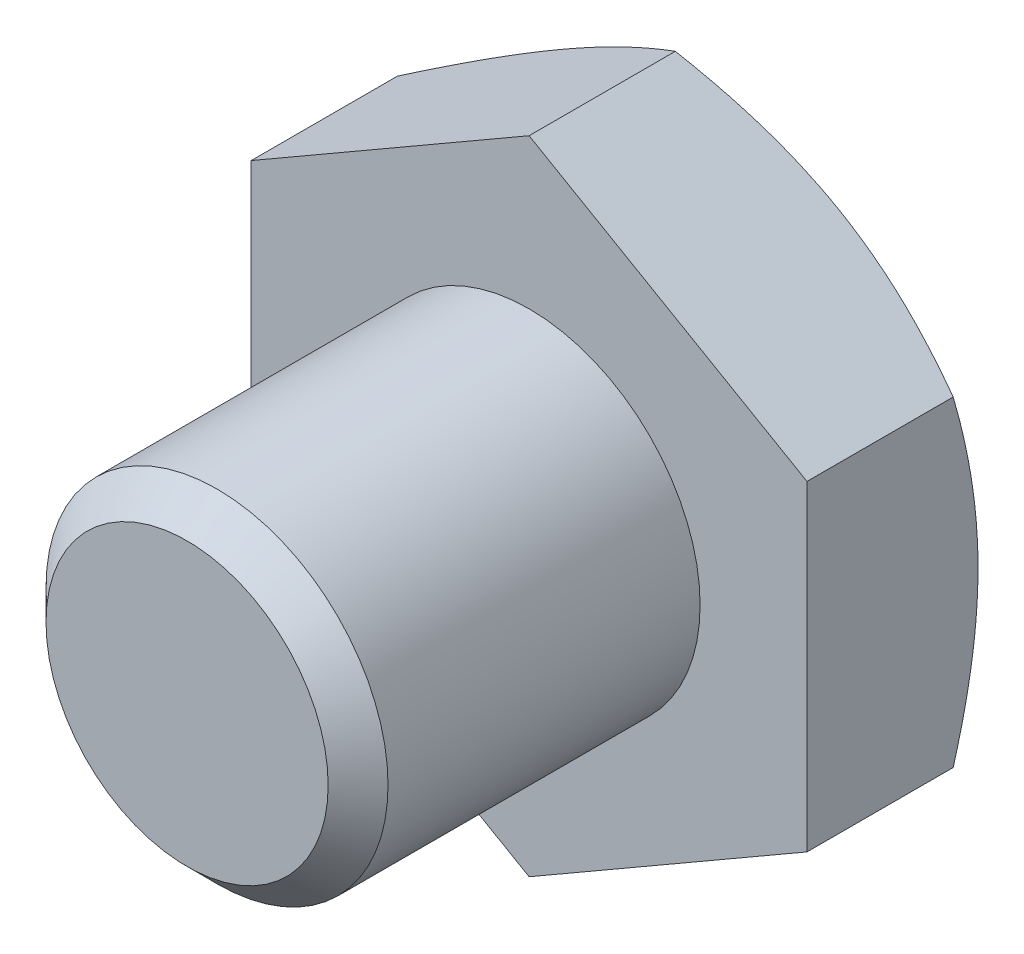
ISO-10303-21;
HEADER;
FILE_DESCRIPTION(('STEP AP214'),'2;1');
FILE_NAME('part.step','',(''),(''),'','','');
FILE_SCHEMA(('AUTOMOTIVE_DESIGN { 1 0 10303 214 1 1 1 1 }'));
ENDSEC;
DATA;
#1=APPLICATION_CONTEXT('core data for automotive mechanical design processes');
#2=APPLICATION_PROTOCOL_DEFINITION('international standard','automotive_design',2000,#1);
#3=PRODUCT_CONTEXT('',#1,'mechanical');
#4=PRODUCT('Part','Part','',(#3));
#5=PRODUCT_RELATED_PRODUCT_CATEGORY('part','',(#4));
#6=PRODUCT_DEFINITION_FORMATION('','',#4);
#7=PRODUCT_DEFINITION_CONTEXT('part definition',#1,'design');
#8=PRODUCT_DEFINITION('design','',#6,#7);
#9=PRODUCT_DEFINITION_SHAPE('','',#8);
#10=(LENGTH_UNIT() NAMED_UNIT(*) SI_UNIT(.MILLI.,.METRE.));
#11=(NAMED_UNIT(*) PLANE_ANGLE_UNIT() SI_UNIT($,.RADIAN.));
#12=(NAMED_UNIT(*) SI_UNIT($,.STERADIAN.) SOLID_ANGLE_UNIT());
#13=UNCERTAINTY_MEASURE_WITH_UNIT(LENGTH_MEASURE(1.E-05),#10,'distance_accuracy_value','');
#14=(GEOMETRIC_REPRESENTATION_CONTEXT(3) GLOBAL_UNCERTAINTY_ASSIGNED_CONTEXT((#13)) GLOBAL_UNIT_ASSIGNED_CONTEXT((#10,
#11,#12)) REPRESENTATION_CONTEXT('',''));
#15=CARTESIAN_POINT('',(0.,0.,0.));
#16=DIRECTION('',(0.,0.,1.));
#17=DIRECTION('',(1.,0.,0.));
#18=AXIS2_PLACEMENT_3D('',#15,#16,#17);
#19=CARTESIAN_POINT('',(0.,0.,8.));
#20=DIRECTION('',(0.,0.,1.));
#21=DIRECTION('',(1.,0.,0.));
#22=AXIS2_PLACEMENT_3D('',#19,#20,#21);
#23=PLANE('',#22);
#24=CARTESIAN_POINT('',(0.,0.,8.));
#25=DIRECTION('',(0.,0.,1.));
#26=DIRECTION('',(1.,0.,0.));
#27=AXIS2_PLACEMENT_3D('',#24,#25,#26);
#28=CIRCLE('',#27,3.3);
#29=CARTESIAN_POINT('',(3.3,0.,8.));
#30=VERTEX_POINT('',#29);
#31=EDGE_CURVE('E203',#30,#30,#28,.T.);
#32=ORIENTED_EDGE('',*,*,#31,.T.);
#33=EDGE_LOOP('',(#32));
#34=FACE_BOUND('',#33,.T.);
#35=ADVANCED_FACE('F29',(#34),#23,.T.);
#36=CARTESIAN_POINT('',(0.,0.,0.));
#37=DIRECTION('',(0.,0.,1.));
#38=DIRECTION('',(1.,0.,0.));
#39=AXIS2_PLACEMENT_3D('',#36,#37,#38);
#40=CYLINDRICAL_SURFACE('',#39,4.);
#41=CARTESIAN_POINT('',(0.,0.,7.29999999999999));
#42=DIRECTION('',(0.,0.,1.));
#43=DIRECTION('',(1.,0.,0.));
#44=AXIS2_PLACEMENT_3D('',#41,#42,#43);
#45=CIRCLE('',#44,4.);
#46=CARTESIAN_POINT('',(4.,0.,7.29999999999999));
#47=VERTEX_POINT('',#46);
#48=EDGE_CURVE('E205',#47,#47,#45,.F.);
#49=ORIENTED_EDGE('',*,*,#48,.T.);
#50=EDGE_LOOP('',(#49));
#51=FACE_BOUND('',#50,.T.);
#52=CARTESIAN_POINT('',(0.,0.,0.));
#53=DIRECTION('',(0.,0.,1.));
#54=DIRECTION('',(1.,0.,0.));
#55=AXIS2_PLACEMENT_3D('',#52,#53,#54);
#56=CIRCLE('',#55,4.);
#57=CARTESIAN_POINT('',(4.,0.,0.));
#58=VERTEX_POINT('',#57);
#59=EDGE_CURVE('E206',#58,#58,#56,.F.);
#60=ORIENTED_EDGE('',*,*,#59,.F.);
#61=EDGE_LOOP('',(#60));
#62=FACE_BOUND('',#61,.T.);
#63=ADVANCED_FACE('F194',(#51,#62),#40,.T.);
#64=CARTESIAN_POINT('',(0.,0.,8.));
#65=DIRECTION('',(0.,0.,-1.));
#66=DIRECTION('',(-1.,0.,0.));
#67=AXIS2_PLACEMENT_3D('',#64,#65,#66);
#68=CONICAL_SURFACE('',#67,3.3,0.785398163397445);
#69=ORIENTED_EDGE('',*,*,#48,.F.);
#70=EDGE_LOOP('',(#69));
#71=FACE_BOUND('',#70,.T.);
#72=ORIENTED_EDGE('',*,*,#31,.F.);
#73=EDGE_LOOP('',(#72));
#74=FACE_BOUND('',#73,.T.);
#75=ADVANCED_FACE('F199',(#71,#74),#68,.T.);
#76=CARTESIAN_POINT('',(0.,7.50555349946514,-4.));
#77=DIRECTION('',(0.499999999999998,0.86602540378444,0.));
#78=DIRECTION('',(-0.86602540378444,0.499999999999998,0.));
#79=AXIS2_PLACEMENT_3D('',#76,#77,#78);
#80=PLANE('',#79);
#81=CARTESIAN_POINT('',(-0.000200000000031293,7.50566896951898,-3.41937674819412));
#82=CARTESIAN_POINT('',(0.14267745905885,7.42317863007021,-3.46699557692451));
#83=CARTESIAN_POINT('',(0.286087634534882,7.34038072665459,-3.51245329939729));
#84=CARTESIAN_POINT('',(0.574072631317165,7.17411251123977,-3.59845131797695));
#85=CARTESIAN_POINT('',(0.718647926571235,7.09064192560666,-3.63898949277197));
#86=CARTESIAN_POINT('',(1.15468865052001,6.8388936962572,-3.75242899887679));
#87=CARTESIAN_POINT('',(1.44787528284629,6.66962231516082,-3.81695219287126));
#88=CARTESIAN_POINT('',(1.88662374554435,6.41631077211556,-3.89261341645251));
#89=CARTESIAN_POINT('',(2.03087463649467,6.33302748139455,-3.91416714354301));
#90=CARTESIAN_POINT('',(2.32002821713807,6.16608458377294,-3.95030968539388));
#91=CARTESIAN_POINT('',(2.46493084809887,6.08242501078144,-3.96489911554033));
#92=CARTESIAN_POINT('',(2.7549877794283,5.91496056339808,-3.98674124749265));
#93=CARTESIAN_POINT('',(2.90014160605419,5.83115596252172,-3.99400227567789));
#94=CARTESIAN_POINT('',(3.19057533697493,5.66347396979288,-4.00103969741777));
#95=CARTESIAN_POINT('',(3.33585523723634,5.57959658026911,-4.0008163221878));
#96=CARTESIAN_POINT('',(3.73387594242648,5.34979921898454,-3.98991654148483));
#97=CARTESIAN_POINT('',(3.98648646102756,5.20395446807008,-3.97161818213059));
#98=CARTESIAN_POINT('',(4.49002967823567,4.91323365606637,-3.91359365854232));
#99=CARTESIAN_POINT('',(4.74096060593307,4.76835861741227,-3.87384766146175));
#100=CARTESIAN_POINT('',(5.24551722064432,4.47705272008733,-3.77449409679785));
#101=CARTESIAN_POINT('',(5.49907924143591,4.33065861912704,-3.71446557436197));
#102=CARTESIAN_POINT('',(6.00242193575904,4.04005357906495,-3.57822500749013));
#103=CARTESIAN_POINT('',(6.25220905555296,3.89583891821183,-3.5020449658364));
#104=CARTESIAN_POINT('',(6.5002,3.75266127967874,-3.41937674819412));
#105=B_SPLINE_CURVE_WITH_KNOTS('',3,(#81,#82,#83,#84,#85,#86,#87,#88,#89,#90,#91,#92,#93,#94,
#95,#96,#97,#98,#99,#100,#101,#102,#103,#104),.UNSPECIFIED.,.F.,.F.,(4,2,2,2,2,2,2,2,2,2,2,4),
(0.,0.515105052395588,1.03043143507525,2.06322554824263,2.56697389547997,3.07067772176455,
3.57380860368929,4.07692394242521,4.95279354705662,5.82947446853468,6.72559912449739,
7.61996451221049),.UNSPECIFIED.);
#106=CARTESIAN_POINT('',(0.,7.50555349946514,-3.41944341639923));
#107=VERTEX_POINT('',#106);
#108=CARTESIAN_POINT('',(3.24999999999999,5.62916512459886,-4.));
#109=VERTEX_POINT('',#108);
#110=EDGE_CURVE('E239',#107,#109,#105,.T.);
#111=ORIENTED_EDGE('',*,*,#110,.F.);
#112=DIRECTION('',(0.,0.,1.));
#113=VECTOR('',#112,1.);
#114=CARTESIAN_POINT('',(0.,7.50555349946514,-4.));
#115=LINE('',#114,#113);
#116=CARTESIAN_POINT('',(0.,7.50555349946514,0.));
#117=VERTEX_POINT('',#116);
#118=EDGE_CURVE('E213',#107,#117,#115,.T.);
#119=ORIENTED_EDGE('',*,*,#118,.T.);
#120=DIRECTION('',(-0.86602540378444,0.499999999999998,0.));
#121=VECTOR('',#120,1.);
#122=CARTESIAN_POINT('',(0.,7.50555349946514,0.));
#123=LINE('',#122,#121);
#124=CARTESIAN_POINT('',(6.5,3.75277674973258,0.));
#125=VERTEX_POINT('',#124);
#126=EDGE_CURVE('E237',#125,#117,#123,.T.);
#127=ORIENTED_EDGE('',*,*,#126,.F.);
#128=DIRECTION('',(0.,0.,1.));
#129=VECTOR('',#128,1.);
#130=CARTESIAN_POINT('',(6.5,3.75277674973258,-4.));
#131=LINE('',#130,#129);
#132=CARTESIAN_POINT('',(6.5,3.75277674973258,-3.41944341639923));
#133=VERTEX_POINT('',#132);
#134=EDGE_CURVE('E210',#133,#125,#131,.T.);
#135=ORIENTED_EDGE('',*,*,#134,.F.);
#136=EDGE_CURVE('E169',#109,#133,#105,.T.);
#137=ORIENTED_EDGE('',*,*,#136,.F.);
#138=EDGE_LOOP('',(#111,#119,#127,#135,#137));
#139=FACE_BOUND('',#138,.T.);
#140=ADVANCED_FACE('F179',(#139),#80,.T.);
#141=CARTESIAN_POINT('',(6.5,-3.75277674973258,-4.));
#142=DIRECTION('',(1.,0.,0.));
#143=DIRECTION('',(0.,1.,0.));
#144=AXIS2_PLACEMENT_3D('',#141,#142,#143);
#145=PLANE('',#144);
#146=CARTESIAN_POINT('',(6.5,-10.1511481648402,-0.793471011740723));
#147=CARTESIAN_POINT('',(6.5,-9.86661061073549,-0.931780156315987));
#148=CARTESIAN_POINT('',(6.5,-9.5814273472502,-1.06878329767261));
#149=CARTESIAN_POINT('',(6.5,-9.00942621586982,-1.33944431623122));
#150=CARTESIAN_POINT('',(6.5,-8.72260810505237,-1.47310167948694));
#151=CARTESIAN_POINT('',(6.5,-8.14555045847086,-1.73699502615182));
#152=CARTESIAN_POINT('',(6.5,-7.85530083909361,-1.86720903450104));
#153=CARTESIAN_POINT('',(6.5,-7.27251720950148,-2.12240075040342));
#154=CARTESIAN_POINT('',(6.5,-6.97998330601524,-2.24737870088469));
#155=CARTESIAN_POINT('',(6.5,-6.38253578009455,-2.49470464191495));
#156=CARTESIAN_POINT('',(6.5,-6.07753050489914,-2.61683241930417));
#157=CARTESIAN_POINT('',(6.5,-5.4639777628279,-2.85201489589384));
#158=CARTESIAN_POINT('',(6.5,-5.15542990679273,-2.96506858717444));
#159=CARTESIAN_POINT('',(6.5,-4.53485688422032,-3.17918767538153));
#160=CARTESIAN_POINT('',(6.5,-4.22283995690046,-3.28027671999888));
#161=CARTESIAN_POINT('',(6.5,-3.59432776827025,-3.467268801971));
#162=CARTESIAN_POINT('',(6.5,-3.27783392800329,-3.55317654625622));
#163=CARTESIAN_POINT('',(6.5,-2.64193299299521,-3.70528378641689));
#164=CARTESIAN_POINT('',(6.5,-2.32255189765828,-3.7715902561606));
#165=CARTESIAN_POINT('',(6.5,-1.67970017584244,-3.88076810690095));
#166=CARTESIAN_POINT('',(6.5,-1.35622997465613,-3.92364190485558));
#167=CARTESIAN_POINT('',(6.5,-0.871400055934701,-3.96753437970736));
#168=CARTESIAN_POINT('',(6.5,-0.710924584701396,-3.97875364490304));
#169=CARTESIAN_POINT('',(6.5,-0.389635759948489,-3.99439800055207));
#170=CARTESIAN_POINT('',(6.5,-0.228822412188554,-3.99882320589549));
#171=CARTESIAN_POINT('',(6.5,0.0928467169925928,-4.00076623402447));
#172=CARTESIAN_POINT('',(6.5,0.253702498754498,-3.9982839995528));
#173=CARTESIAN_POINT('',(6.5,0.575165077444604,-3.98647562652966));
#174=CARTESIAN_POINT('',(6.5,0.735771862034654,-3.97714915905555));
#175=CARTESIAN_POINT('',(6.5,1.1195616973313,-3.94688326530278));
#176=CARTESIAN_POINT('',(6.5,1.34250362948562,-3.92281852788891));
#177=CARTESIAN_POINT('',(6.5,1.7867691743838,-3.86279653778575));
#178=CARTESIAN_POINT('',(6.5,2.00809257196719,-3.82683773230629));
#179=CARTESIAN_POINT('',(6.5,2.6693552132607,-3.70302394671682));
#180=CARTESIAN_POINT('',(6.5,3.10635568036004,-3.59925227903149));
#181=CARTESIAN_POINT('',(6.5,3.76002718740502,-3.41880250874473));
#182=CARTESIAN_POINT('',(6.5,3.98007311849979,-3.35364298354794));
#183=CARTESIAN_POINT('',(6.5,4.41802816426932,-3.21643617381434));
#184=CARTESIAN_POINT('',(6.5,4.63593726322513,-3.14438883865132));
#185=CARTESIAN_POINT('',(6.5,5.06968702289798,-2.99457255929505));
#186=CARTESIAN_POINT('',(6.5,5.28552829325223,-2.916805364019));
#187=CARTESIAN_POINT('',(6.5,5.71541228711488,-2.75647654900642));
#188=CARTESIAN_POINT('',(6.5,5.9294550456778,-2.67391502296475));
#189=CARTESIAN_POINT('',(6.5,6.48683269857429,-2.45289360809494));
#190=CARTESIAN_POINT('',(6.5,6.82889406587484,-2.31122578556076));
#191=CARTESIAN_POINT('',(6.5,7.50966899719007,-2.0200359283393));
#192=CARTESIAN_POINT('',(6.5,7.84838223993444,-1.87051314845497));
#193=CARTESIAN_POINT('',(6.5,8.5231934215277,-1.5654022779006));
#194=CARTESIAN_POINT('',(6.5,8.85929044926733,-1.40981217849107));
#195=CARTESIAN_POINT('',(6.5,9.5292616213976,-1.09396134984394));
#196=CARTESIAN_POINT('',(6.5,9.86313584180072,-0.933700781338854));
#197=CARTESIAN_POINT('',(6.5,10.5295677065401,-0.60925556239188));
#198=CARTESIAN_POINT('',(6.5,10.8621227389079,-0.445065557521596));
#199=CARTESIAN_POINT('',(6.5,11.5257555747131,-0.113725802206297));
#200=CARTESIAN_POINT('',(6.5,11.8568333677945,0.0534239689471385));
#201=CARTESIAN_POINT('',(6.5,12.5177031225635,0.390087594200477));
#202=CARTESIAN_POINT('',(6.5,12.8474953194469,0.559600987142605));
#203=CARTESIAN_POINT('',(6.5,13.5060616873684,0.900594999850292));
#204=CARTESIAN_POINT('',(6.5,13.8348358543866,1.07207562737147));
#205=CARTESIAN_POINT('',(6.5,14.7542734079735,1.55452408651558));
#206=CARTESIAN_POINT('',(6.50000000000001,15.3439832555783,1.86730883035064));
#207=CARTESIAN_POINT('',(6.50000000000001,16.5213822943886,2.49672516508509));
#208=CARTESIAN_POINT('',(6.50000000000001,17.1090713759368,2.81335696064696));
#209=CARTESIAN_POINT('',(6.50000000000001,18.2810762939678,3.44851591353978));
#210=CARTESIAN_POINT('',(6.50000000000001,18.8653969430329,3.76703419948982));
#211=CARTESIAN_POINT('',(6.50000000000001,20.0327707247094,4.40628789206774));
#212=CARTESIAN_POINT('',(6.50000000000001,20.6158239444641,4.72702313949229));
#213=CARTESIAN_POINT('',(6.50000000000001,21.1984268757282,5.0485682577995));
#214=B_SPLINE_CURVE_WITH_KNOTS('',3,(#146,#147,#148,#149,#150,#151,#152,#153,#154,#155,#156,
#157,#158,#159,#160,#161,#162,#163,#164,#165,#166,#167,#168,#169,#170,#171,#172,#173,#174,#175,
#176,#177,#178,#179,#180,#181,#182,#183,#184,#185,#186,#187,#188,#189,#190,#191,#192,#193,#194,
#195,#196,#197,#198,#199,#200,#201,#202,#203,#204,#205,#206,#207,#208,#209,#210,#211,#212,#213),
.UNSPECIFIED.,.F.,.F.,(4,2,2,2,2,2,2,2,2,2,2,2,2,2,2,2,2,2,2,2,2,2,2,2,2,2,2,2,2,2,2,2,2,4),(0.,
0.949126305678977,1.89839752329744,2.85271700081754,3.80699215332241,4.79252293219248,
5.77816302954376,6.76182130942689,7.7451740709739,8.72305667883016,9.70083840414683,
10.1833179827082,10.6657894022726,11.1482648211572,11.63076342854,12.3030962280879,
12.9755168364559,14.321051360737,15.0094640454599,15.6978817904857,16.3860899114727,
17.0742845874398,18.1848536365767,19.295528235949,20.4065737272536,21.5175810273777,
22.6301997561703,23.7428262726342,24.8552386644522,25.9676554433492,27.9702138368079,
29.9728792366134,31.9693608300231,33.9657005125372),.UNSPECIFIED.);
#215=CARTESIAN_POINT('',(6.5,0.,-4.));
#216=VERTEX_POINT('',#215);
#217=EDGE_CURVE('E167',#133,#216,#214,.F.);
#218=ORIENTED_EDGE('',*,*,#217,.F.);
#219=ORIENTED_EDGE('',*,*,#134,.T.);
#220=DIRECTION('',(0.,1.,0.));
#221=VECTOR('',#220,1.);
#222=CARTESIAN_POINT('',(6.5,-3.75277674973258,0.));
#223=LINE('',#222,#221);
#224=CARTESIAN_POINT('',(6.5,-3.75277674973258,0.));
#225=VERTEX_POINT('',#224);
#226=EDGE_CURVE('E215',#225,#125,#223,.T.);
#227=ORIENTED_EDGE('',*,*,#226,.F.);
#228=DIRECTION('',(0.,0.,1.));
#229=VECTOR('',#228,1.);
#230=CARTESIAN_POINT('',(6.5,-3.75277674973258,-4.));
#231=LINE('',#230,#229);
#232=CARTESIAN_POINT('',(6.5,-3.75277674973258,-3.41944341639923));
#233=VERTEX_POINT('',#232);
#234=EDGE_CURVE('E221',#233,#225,#231,.T.);
#235=ORIENTED_EDGE('',*,*,#234,.F.);
#236=EDGE_CURVE('E162',#216,#233,#214,.F.);
#237=ORIENTED_EDGE('',*,*,#236,.F.);
#238=EDGE_LOOP('',(#218,#219,#227,#235,#237));
#239=FACE_BOUND('',#238,.T.);
#240=ADVANCED_FACE('F175',(#239),#145,.T.);
#241=CARTESIAN_POINT('',(0.,-7.50555349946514,-4.));
#242=DIRECTION('',(0.499999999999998,-0.86602540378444,0.));
#243=DIRECTION('',(0.86602540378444,0.499999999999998,0.));
#244=AXIS2_PLACEMENT_3D('',#241,#242,#243);
#245=PLANE('',#244);
#246=CARTESIAN_POINT('',(6.5002,-3.75266127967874,-3.41937674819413));
#247=CARTESIAN_POINT('',(6.35732254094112,-3.83515161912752,-3.46699557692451));
#248=CARTESIAN_POINT('',(6.21391236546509,-3.91794952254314,-3.51245329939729));
#249=CARTESIAN_POINT('',(5.9259273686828,-4.08421773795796,-3.59845131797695));
#250=CARTESIAN_POINT('',(5.78135207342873,-4.16768832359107,-3.63898949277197));
#251=CARTESIAN_POINT('',(5.34531134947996,-4.41943655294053,-3.75242899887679));
#252=CARTESIAN_POINT('',(5.05212471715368,-4.58870793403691,-3.81695219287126));
#253=CARTESIAN_POINT('',(4.61337625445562,-4.84201947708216,-3.89261341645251));
#254=CARTESIAN_POINT('',(4.4691253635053,-4.92530276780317,-3.91416714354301));
#255=CARTESIAN_POINT('',(4.17997178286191,-5.09224566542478,-3.95030968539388));
#256=CARTESIAN_POINT('',(4.0350691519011,-5.17590523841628,-3.96489911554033));
#257=CARTESIAN_POINT('',(3.74501222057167,-5.34336968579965,-3.98674124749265));
#258=CARTESIAN_POINT('',(3.59985839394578,-5.42717428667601,-3.99400227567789));
#259=CARTESIAN_POINT('',(3.30942466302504,-5.59485627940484,-4.00103969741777));
#260=CARTESIAN_POINT('',(3.16414476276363,-5.67873366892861,-4.0008163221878));
#261=CARTESIAN_POINT('',(2.76612405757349,-5.90853103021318,-3.98991654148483));
#262=CARTESIAN_POINT('',(2.51351353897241,-6.05437578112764,-3.97161818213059));
#263=CARTESIAN_POINT('',(2.0099703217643,-6.34509659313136,-3.91359365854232));
#264=CARTESIAN_POINT('',(1.7590393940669,-6.48997163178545,-3.87384766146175));
#265=CARTESIAN_POINT('',(1.25448277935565,-6.78127752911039,-3.77449409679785));
#266=CARTESIAN_POINT('',(1.00092075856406,-6.92767163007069,-3.71446557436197));
#267=CARTESIAN_POINT('',(0.497578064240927,-7.21827667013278,-3.57822500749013));
#268=CARTESIAN_POINT('',(0.247790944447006,-7.3624913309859,-3.5020449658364));
#269=CARTESIAN_POINT('',(-0.00020000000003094,-7.50566896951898,-3.41937674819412));
#270=B_SPLINE_CURVE_WITH_KNOTS('',3,(#246,#247,#248,#249,#250,#251,#252,#253,#254,#255,#256,
#257,#258,#259,#260,#261,#262,#263,#264,#265,#266,#267,#268,#269),.UNSPECIFIED.,.F.,.F.,(4,2,2,
2,2,2,2,2,2,2,2,4),(0.,0.515105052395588,1.03043143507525,2.06322554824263,2.56697389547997,
3.07067772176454,3.57380860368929,4.07692394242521,4.95279354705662,5.82947446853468,
6.72559912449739,7.61996451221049),.UNSPECIFIED.);
#271=CARTESIAN_POINT('',(3.24999999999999,-5.62916512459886,-4.));
#272=VERTEX_POINT('',#271);
#273=EDGE_CURVE('E168',#233,#272,#270,.T.);
#274=ORIENTED_EDGE('',*,*,#273,.F.);
#275=ORIENTED_EDGE('',*,*,#234,.T.);
#276=DIRECTION('',(0.86602540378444,0.499999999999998,0.));
#277=VECTOR('',#276,1.);
#278=CARTESIAN_POINT('',(0.,-7.50555349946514,0.));
#279=LINE('',#278,#277);
#280=CARTESIAN_POINT('',(0.,-7.50555349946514,0.));
#281=VERTEX_POINT('',#280);
#282=EDGE_CURVE('E226',#281,#225,#279,.T.);
#283=ORIENTED_EDGE('',*,*,#282,.F.);
#284=DIRECTION('',(0.,0.,1.));
#285=VECTOR('',#284,1.);
#286=CARTESIAN_POINT('',(0.,-7.50555349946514,-4.));
#287=LINE('',#286,#285);
#288=CARTESIAN_POINT('',(0.,-7.50555349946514,-3.41944341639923));
#289=VERTEX_POINT('',#288);
#290=EDGE_CURVE('E219',#289,#281,#287,.T.);
#291=ORIENTED_EDGE('',*,*,#290,.F.);
#292=EDGE_CURVE('E156',#272,#289,#270,.T.);
#293=ORIENTED_EDGE('',*,*,#292,.F.);
#294=EDGE_LOOP('',(#274,#275,#283,#291,#293));
#295=FACE_BOUND('',#294,.T.);
#296=ADVANCED_FACE('F178',(#295),#245,.T.);
#297=CARTESIAN_POINT('',(0.,-7.50555349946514,-4.));
#298=DIRECTION('',(-0.500000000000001,-0.866025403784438,0.));
#299=DIRECTION('',(0.866025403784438,-0.500000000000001,0.));
#300=AXIS2_PLACEMENT_3D('',#297,#298,#299);
#301=PLANE('',#300);
#302=CARTESIAN_POINT('',(0.000199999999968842,-7.50566896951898,-3.41937674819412));
#303=CARTESIAN_POINT('',(-0.142677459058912,-7.42317863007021,-3.46699557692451));
#304=CARTESIAN_POINT('',(-0.286087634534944,-7.34038072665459,-3.51245329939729));
#305=CARTESIAN_POINT('',(-0.574072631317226,-7.17411251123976,-3.59845131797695));
#306=CARTESIAN_POINT('',(-0.718647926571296,-7.09064192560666,-3.63898949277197));
#307=CARTESIAN_POINT('',(-1.15468865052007,-6.83889369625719,-3.75242899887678));
#308=CARTESIAN_POINT('',(-1.44787528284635,-6.66962231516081,-3.81695219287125));
#309=CARTESIAN_POINT('',(-1.88662374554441,-6.41631077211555,-3.8926134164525));
#310=CARTESIAN_POINT('',(-2.03087463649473,-6.33302748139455,-3.91416714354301));
#311=CARTESIAN_POINT('',(-2.32002821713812,-6.16608458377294,-3.95030968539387));
#312=CARTESIAN_POINT('',(-2.46493084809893,-6.08242501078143,-3.96489911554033));
#313=CARTESIAN_POINT('',(-2.75498777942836,-5.91496056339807,-3.98674124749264));
#314=CARTESIAN_POINT('',(-2.90014160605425,-5.8311559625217,-3.99400227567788));
#315=CARTESIAN_POINT('',(-3.19057533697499,-5.66347396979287,-4.00103969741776));
#316=CARTESIAN_POINT('',(-3.3358552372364,-5.5795965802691,-4.00081632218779));
#317=CARTESIAN_POINT('',(-3.73387594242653,-5.34979921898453,-3.98991654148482));
#318=CARTESIAN_POINT('',(-3.9864864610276,-5.20395446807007,-3.97161818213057));
#319=CARTESIAN_POINT('',(-4.4900296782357,-4.91323365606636,-3.91359365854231));
#320=CARTESIAN_POINT('',(-4.74096060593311,-4.76835861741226,-3.87384766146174));
#321=CARTESIAN_POINT('',(-5.24551722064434,-4.47705272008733,-3.77449409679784));
#322=CARTESIAN_POINT('',(-5.49907924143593,-4.33065861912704,-3.71446557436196));
#323=CARTESIAN_POINT('',(-6.00242193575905,-4.04005357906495,-3.57822500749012));
#324=CARTESIAN_POINT('',(-6.25220905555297,-3.89583891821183,-3.5020449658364));
#325=CARTESIAN_POINT('',(-6.5002,-3.75266127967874,-3.41937674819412));
#326=B_SPLINE_CURVE_WITH_KNOTS('',3,(#302,#303,#304,#305,#306,#307,#308,#309,#310,#311,#312,
#313,#314,#315,#316,#317,#318,#319,#320,#321,#322,#323,#324,#325),.UNSPECIFIED.,.F.,.F.,(4,2,2,
2,2,2,2,2,2,2,2,4),(0.,0.515105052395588,1.03043143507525,2.06322554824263,2.56697389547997,
3.07067772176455,3.57380860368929,4.07692394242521,4.9527935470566,5.82947446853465,
6.72559912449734,7.61996451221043),.UNSPECIFIED.);
#327=CARTESIAN_POINT('',(-3.25000000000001,-5.62916512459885,-4.));
#328=VERTEX_POINT('',#327);
#329=EDGE_CURVE('E258',#289,#328,#326,.T.);
#330=ORIENTED_EDGE('',*,*,#329,.F.);
#331=ORIENTED_EDGE('',*,*,#290,.T.);
#332=DIRECTION('',(0.866025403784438,-0.500000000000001,0.));
#333=VECTOR('',#332,1.);
#334=CARTESIAN_POINT('',(0.,-7.50555349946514,0.));
#335=LINE('',#334,#333);
#336=CARTESIAN_POINT('',(-6.5,-3.75277674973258,0.));
#337=VERTEX_POINT('',#336);
#338=EDGE_CURVE('E229',#337,#281,#335,.T.);
#339=ORIENTED_EDGE('',*,*,#338,.F.);
#340=DIRECTION('',(0.,0.,1.));
#341=VECTOR('',#340,1.);
#342=CARTESIAN_POINT('',(-6.5,-3.75277674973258,-4.));
#343=LINE('',#342,#341);
#344=CARTESIAN_POINT('',(-6.5,-3.75277674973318,-3.41944341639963));
#345=VERTEX_POINT('',#344);
#346=EDGE_CURVE('E217',#345,#337,#343,.T.);
#347=ORIENTED_EDGE('',*,*,#346,.F.);
#348=EDGE_CURVE('E105',#328,#345,#326,.T.);
#349=ORIENTED_EDGE('',*,*,#348,.F.);
#350=EDGE_LOOP('',(#330,#331,#339,#347,#349));
#351=FACE_BOUND('',#350,.T.);
#352=ADVANCED_FACE('F183',(#351),#301,.T.);
#353=CARTESIAN_POINT('',(-6.5,-3.75277674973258,-4.));
#354=DIRECTION('',(-1.,0.,0.));
#355=DIRECTION('',(0.,0.,1.));
#356=AXIS2_PLACEMENT_3D('',#353,#354,#355);
#357=PLANE('',#356);
#358=CARTESIAN_POINT('',(-6.5,-10.1511481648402,-0.793471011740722));
#359=CARTESIAN_POINT('',(-6.5,-9.86661061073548,-0.931780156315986));
#360=CARTESIAN_POINT('',(-6.5,-9.58142734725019,-1.06878329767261));
#361=CARTESIAN_POINT('',(-6.5,-9.00942621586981,-1.33944431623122));
#362=CARTESIAN_POINT('',(-6.5,-8.72260810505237,-1.47310167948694));
#363=CARTESIAN_POINT('',(-6.5,-8.14555045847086,-1.73699502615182));
#364=CARTESIAN_POINT('',(-6.5,-7.8553008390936,-1.86720903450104));
#365=CARTESIAN_POINT('',(-6.5,-7.27251720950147,-2.12240075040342));
#366=CARTESIAN_POINT('',(-6.5,-6.97998330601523,-2.2473787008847));
#367=CARTESIAN_POINT('',(-6.5,-6.38253578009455,-2.49470464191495));
#368=CARTESIAN_POINT('',(-6.5,-6.07753050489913,-2.61683241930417));
#369=CARTESIAN_POINT('',(-6.5,-5.4639777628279,-2.85201489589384));
#370=CARTESIAN_POINT('',(-6.5,-5.15542990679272,-2.96506858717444));
#371=CARTESIAN_POINT('',(-6.5,-4.53485688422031,-3.17918767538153));
#372=CARTESIAN_POINT('',(-6.5,-4.22283995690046,-3.28027671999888));
#373=CARTESIAN_POINT('',(-6.5,-3.59432776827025,-3.467268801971));
#374=CARTESIAN_POINT('',(-6.5,-3.27783392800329,-3.55317654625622));
#375=CARTESIAN_POINT('',(-6.5,-2.64193299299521,-3.70528378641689));
#376=CARTESIAN_POINT('',(-6.5,-2.32255189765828,-3.7715902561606));
#377=CARTESIAN_POINT('',(-6.5,-1.67970017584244,-3.88076810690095));
#378=CARTESIAN_POINT('',(-6.5,-1.35622997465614,-3.92364190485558));
#379=CARTESIAN_POINT('',(-6.5,-0.871400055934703,-3.96753437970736));
#380=CARTESIAN_POINT('',(-6.5,-0.710924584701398,-3.97875364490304));
#381=CARTESIAN_POINT('',(-6.5,-0.389635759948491,-3.99439800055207));
#382=CARTESIAN_POINT('',(-6.5,-0.228822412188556,-3.99882320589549));
#383=CARTESIAN_POINT('',(-6.5,0.0928467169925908,-4.00076623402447));
#384=CARTESIAN_POINT('',(-6.5,0.253702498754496,-3.9982839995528));
#385=CARTESIAN_POINT('',(-6.5,0.575165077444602,-3.98647562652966));
#386=CARTESIAN_POINT('',(-6.5,0.735771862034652,-3.97714915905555));
#387=CARTESIAN_POINT('',(-6.5,1.1195616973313,-3.94688326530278));
#388=CARTESIAN_POINT('',(-6.5,1.34250362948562,-3.92281852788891));
#389=CARTESIAN_POINT('',(-6.5,1.7867691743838,-3.86279653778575));
#390=CARTESIAN_POINT('',(-6.5,2.00809257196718,-3.82683773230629));
#391=CARTESIAN_POINT('',(-6.5,2.6693552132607,-3.70302394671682));
#392=CARTESIAN_POINT('',(-6.5,3.10635568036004,-3.59925227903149));
#393=CARTESIAN_POINT('',(-6.5,3.76002718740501,-3.41880250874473));
#394=CARTESIAN_POINT('',(-6.5,3.98007311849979,-3.35364298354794));
#395=CARTESIAN_POINT('',(-6.5,4.41802816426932,-3.21643617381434));
#396=CARTESIAN_POINT('',(-6.5,4.63593726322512,-3.14438883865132));
#397=CARTESIAN_POINT('',(-6.5,5.06968702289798,-2.99457255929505));
#398=CARTESIAN_POINT('',(-6.5,5.28552829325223,-2.916805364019));
#399=CARTESIAN_POINT('',(-6.5,5.71541228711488,-2.75647654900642));
#400=CARTESIAN_POINT('',(-6.5,5.9294550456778,-2.67391502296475));
#401=CARTESIAN_POINT('',(-6.5,6.48683269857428,-2.45289360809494));
#402=CARTESIAN_POINT('',(-6.5,6.82889406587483,-2.31122578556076));
#403=CARTESIAN_POINT('',(-6.5,7.50966899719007,-2.0200359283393));
#404=CARTESIAN_POINT('',(-6.5,7.84838223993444,-1.87051314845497));
#405=CARTESIAN_POINT('',(-6.5,8.5231934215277,-1.5654022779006));
#406=CARTESIAN_POINT('',(-6.5,8.85929044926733,-1.40981217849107));
#407=CARTESIAN_POINT('',(-6.5,9.5292616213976,-1.09396134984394));
#408=CARTESIAN_POINT('',(-6.5,9.86313584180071,-0.933700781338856));
#409=CARTESIAN_POINT('',(-6.5,10.5295677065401,-0.609255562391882));
#410=CARTESIAN_POINT('',(-6.5,10.8621227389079,-0.445065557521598));
#411=CARTESIAN_POINT('',(-6.5,11.5257555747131,-0.113725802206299));
#412=CARTESIAN_POINT('',(-6.5,11.8568333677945,0.0534239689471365));
#413=CARTESIAN_POINT('',(-6.5,12.5177031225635,0.390087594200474));
#414=CARTESIAN_POINT('',(-6.5,12.8474953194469,0.559600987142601));
#415=CARTESIAN_POINT('',(-6.5,13.5060616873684,0.900594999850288));
#416=CARTESIAN_POINT('',(-6.5,13.8348358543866,1.07207562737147));
#417=CARTESIAN_POINT('',(-6.5,14.7542734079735,1.55452408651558));
#418=CARTESIAN_POINT('',(-6.5,15.3439832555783,1.86730883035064));
#419=CARTESIAN_POINT('',(-6.5,16.5213822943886,2.49672516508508));
#420=CARTESIAN_POINT('',(-6.5,17.1090713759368,2.81335696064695));
#421=CARTESIAN_POINT('',(-6.5,18.2810762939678,3.44851591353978));
#422=CARTESIAN_POINT('',(-6.5,18.8653969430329,3.76703419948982));
#423=CARTESIAN_POINT('',(-6.5,20.0327707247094,4.40628789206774));
#424=CARTESIAN_POINT('',(-6.5,20.6158239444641,4.72702313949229));
#425=CARTESIAN_POINT('',(-6.5,21.1984268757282,5.0485682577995));
#426=B_SPLINE_CURVE_WITH_KNOTS('',3,(#358,#359,#360,#361,#362,#363,#364,#365,#366,#367,#368,
#369,#370,#371,#372,#373,#374,#375,#376,#377,#378,#379,#380,#381,#382,#383,#384,#385,#386,#387,
#388,#389,#390,#391,#392,#393,#394,#395,#396,#397,#398,#399,#400,#401,#402,#403,#404,#405,#406,
#407,#408,#409,#410,#411,#412,#413,#414,#415,#416,#417,#418,#419,#420,#421,#422,#423,#424,#425),
.UNSPECIFIED.,.F.,.F.,(4,2,2,2,2,2,2,2,2,2,2,2,2,2,2,2,2,2,2,2,2,2,2,2,2,2,2,2,2,2,2,2,2,4),(0.,
0.949126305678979,1.89839752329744,2.85271700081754,3.80699215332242,4.79252293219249,
5.77816302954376,6.76182130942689,7.7451740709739,8.72305667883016,9.70083840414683,
10.1833179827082,10.6657894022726,11.1482648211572,11.63076342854,12.3030962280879,
12.9755168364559,14.321051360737,15.0094640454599,15.6978817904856,16.3860899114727,
17.0742845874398,18.1848536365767,19.295528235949,20.4065737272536,21.5175810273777,
22.6301997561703,23.7428262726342,24.8552386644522,25.9676554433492,27.9702138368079,
29.9728792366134,31.9693608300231,33.9657005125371),.UNSPECIFIED.);
#427=CARTESIAN_POINT('',(-6.5,0.,-4.));
#428=VERTEX_POINT('',#427);
#429=EDGE_CURVE('E100',#345,#428,#426,.T.);
#430=ORIENTED_EDGE('',*,*,#429,.F.);
#431=ORIENTED_EDGE('',*,*,#346,.T.);
#432=DIRECTION('',(0.,-1.,0.));
#433=VECTOR('',#432,1.);
#434=CARTESIAN_POINT('',(-6.5,-3.75277674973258,0.));
#435=LINE('',#434,#433);
#436=CARTESIAN_POINT('',(-6.5,3.75277674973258,0.));
#437=VERTEX_POINT('',#436);
#438=EDGE_CURVE('E232',#437,#337,#435,.T.);
#439=ORIENTED_EDGE('',*,*,#438,.F.);
#440=DIRECTION('',(0.,0.,1.));
#441=VECTOR('',#440,1.);
#442=CARTESIAN_POINT('',(-6.5,3.75277674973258,-4.));
#443=LINE('',#442,#441);
#444=CARTESIAN_POINT('',(-6.5,3.75277674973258,-3.41944341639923));
#445=VERTEX_POINT('',#444);
#446=EDGE_CURVE('E126',#445,#437,#443,.T.);
#447=ORIENTED_EDGE('',*,*,#446,.F.);
#448=EDGE_CURVE('E109',#428,#445,#426,.T.);
#449=ORIENTED_EDGE('',*,*,#448,.F.);
#450=EDGE_LOOP('',(#430,#431,#439,#447,#449));
#451=FACE_BOUND('',#450,.T.);
#452=ADVANCED_FACE('F124',(#451),#357,.T.);
#453=CARTESIAN_POINT('',(-6.5,3.75277674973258,-4.));
#454=DIRECTION('',(-0.500000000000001,0.866025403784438,0.));
#455=DIRECTION('',(-0.866025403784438,-0.500000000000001,0.));
#456=AXIS2_PLACEMENT_3D('',#453,#454,#455);
#457=PLANE('',#456);
#458=CARTESIAN_POINT('',(-6.5002,3.75266127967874,-3.41937674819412));
#459=CARTESIAN_POINT('',(-6.35732254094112,3.83515161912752,-3.46699557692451));
#460=CARTESIAN_POINT('',(-6.21391236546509,3.91794952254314,-3.51245329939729));
#461=CARTESIAN_POINT('',(-5.92592736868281,4.08421773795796,-3.59845131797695));
#462=CARTESIAN_POINT('',(-5.78135207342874,4.16768832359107,-3.63898949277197));
#463=CARTESIAN_POINT('',(-5.34531134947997,4.41943655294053,-3.75242899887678));
#464=CARTESIAN_POINT('',(-5.05212471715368,4.58870793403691,-3.81695219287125));
#465=CARTESIAN_POINT('',(-4.61337625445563,4.84201947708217,-3.8926134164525));
#466=CARTESIAN_POINT('',(-4.46912536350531,4.92530276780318,-3.91416714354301));
#467=CARTESIAN_POINT('',(-4.17997178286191,5.09224566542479,-3.95030968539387));
#468=CARTESIAN_POINT('',(-4.03506915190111,5.17590523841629,-3.96489911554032));
#469=CARTESIAN_POINT('',(-3.74501222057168,5.34336968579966,-3.98674124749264));
#470=CARTESIAN_POINT('',(-3.59985839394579,5.42717428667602,-3.99400227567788));
#471=CARTESIAN_POINT('',(-3.30942466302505,5.59485627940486,-4.00103969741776));
#472=CARTESIAN_POINT('',(-3.16414476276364,5.67873366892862,-4.00081632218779));
#473=CARTESIAN_POINT('',(-2.76612405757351,5.90853103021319,-3.98991654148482));
#474=CARTESIAN_POINT('',(-2.51351353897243,6.05437578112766,-3.97161818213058));
#475=CARTESIAN_POINT('',(-2.00997032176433,6.34509659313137,-3.91359365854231));
#476=CARTESIAN_POINT('',(-1.75903939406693,6.48997163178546,-3.87384766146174));
#477=CARTESIAN_POINT('',(-1.25448277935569,6.7812775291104,-3.77449409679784));
#478=CARTESIAN_POINT('',(-1.0009207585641,6.92767163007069,-3.71446557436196));
#479=CARTESIAN_POINT('',(-0.49757806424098,7.21827667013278,-3.57822500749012));
#480=CARTESIAN_POINT('',(-0.247790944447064,7.3624913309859,-3.5020449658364));
#481=CARTESIAN_POINT('',(0.000199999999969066,7.50566896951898,-3.41937674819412));
#482=B_SPLINE_CURVE_WITH_KNOTS('',3,(#458,#459,#460,#461,#462,#463,#464,#465,#466,#467,#468,
#469,#470,#471,#472,#473,#474,#475,#476,#477,#478,#479,#480,#481),.UNSPECIFIED.,.F.,.F.,(4,2,2,
2,2,2,2,2,2,2,2,4),(0.,0.51510505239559,1.03043143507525,2.06322554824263,2.56697389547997,
3.07067772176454,3.57380860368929,4.07692394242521,4.9527935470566,5.82947446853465,
6.72559912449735,7.61996451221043),.UNSPECIFIED.);
#483=CARTESIAN_POINT('',(-3.25000000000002,5.62916512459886,-4.));
#484=VERTEX_POINT('',#483);
#485=EDGE_CURVE('E115',#445,#484,#482,.T.);
#486=ORIENTED_EDGE('',*,*,#485,.F.);
#487=ORIENTED_EDGE('',*,*,#446,.T.);
#488=DIRECTION('',(-0.866025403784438,-0.500000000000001,0.));
#489=VECTOR('',#488,1.);
#490=CARTESIAN_POINT('',(-6.5,3.75277674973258,0.));
#491=LINE('',#490,#489);
#492=EDGE_CURVE('E235',#117,#437,#491,.T.);
#493=ORIENTED_EDGE('',*,*,#492,.F.);
#494=ORIENTED_EDGE('',*,*,#118,.F.);
#495=EDGE_CURVE('E117',#484,#107,#482,.T.);
#496=ORIENTED_EDGE('',*,*,#495,.F.);
#497=EDGE_LOOP('',(#486,#487,#493,#494,#496));
#498=FACE_BOUND('',#497,.T.);
#499=ADVANCED_FACE('F191',(#498),#457,.T.);
#500=CARTESIAN_POINT('',(6.5,3.75277674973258,0.));
#501=DIRECTION('',(0.,0.,1.));
#502=DIRECTION('',(1.,0.,0.));
#503=AXIS2_PLACEMENT_3D('',#500,#501,#502);
#504=PLANE('',#503);
#505=ORIENTED_EDGE('',*,*,#59,.T.);
#506=EDGE_LOOP('',(#505));
#507=FACE_BOUND('',#506,.T.);
#508=ORIENTED_EDGE('',*,*,#126,.T.);
#509=ORIENTED_EDGE('',*,*,#492,.T.);
#510=ORIENTED_EDGE('',*,*,#438,.T.);
#511=ORIENTED_EDGE('',*,*,#338,.T.);
#512=ORIENTED_EDGE('',*,*,#282,.T.);
#513=ORIENTED_EDGE('',*,*,#226,.T.);
#514=EDGE_LOOP('',(#508,#509,#510,#511,#512,#513));
#515=FACE_BOUND('',#514,.T.);
#516=ADVANCED_FACE('F148',(#507,#515),#504,.T.);
#517=CARTESIAN_POINT('',(0.,0.,0.));
#518=DIRECTION('',(0.,0.,1.));
#519=DIRECTION('',(1.,0.,0.));
#520=AXIS2_PLACEMENT_3D('',#517,#518,#519);
#521=CONICAL_SURFACE('',#520,13.4282032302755,1.0471975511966);
#522=ORIENTED_EDGE('',*,*,#136,.T.);
#523=ORIENTED_EDGE('',*,*,#217,.T.);
#524=CARTESIAN_POINT('',(0.,0.,-4.));
#525=DIRECTION('',(0.,0.,1.));
#526=DIRECTION('',(1.,0.,0.));
#527=AXIS2_PLACEMENT_3D('',#524,#525,#526);
#528=CIRCLE('',#527,6.5);
#529=EDGE_CURVE('E32',#109,#216,#528,.F.);
#530=ORIENTED_EDGE('',*,*,#529,.F.);
#531=EDGE_LOOP('',(#522,#523,#530));
#532=FACE_BOUND('',#531,.T.);
#533=ADVANCED_FACE('F248',(#532),#521,.T.);
#534=ORIENTED_EDGE('',*,*,#110,.T.);
#535=EDGE_CURVE('E122',#484,#109,#528,.F.);
#536=ORIENTED_EDGE('',*,*,#535,.F.);
#537=ORIENTED_EDGE('',*,*,#495,.T.);
#538=EDGE_LOOP('',(#534,#536,#537));
#539=FACE_BOUND('',#538,.T.);
#540=ADVANCED_FACE('F147',(#539),#521,.T.);
#541=ORIENTED_EDGE('',*,*,#448,.T.);
#542=ORIENTED_EDGE('',*,*,#485,.T.);
#543=CARTESIAN_POINT('',(0.,0.,-4.));
#544=DIRECTION('',(0.,0.,-1.));
#545=DIRECTION('',(-1.,0.,0.));
#546=AXIS2_PLACEMENT_3D('',#543,#544,#545);
#547=CIRCLE('',#546,6.5);
#548=EDGE_CURVE('E50',#428,#484,#547,.T.);
#549=ORIENTED_EDGE('',*,*,#548,.F.);
#550=EDGE_LOOP('',(#541,#542,#549));
#551=FACE_BOUND('',#550,.T.);
#552=ADVANCED_FACE('F113',(#551),#521,.T.);
#553=ORIENTED_EDGE('',*,*,#348,.T.);
#554=ORIENTED_EDGE('',*,*,#429,.T.);
#555=EDGE_CURVE('E102',#328,#428,#528,.F.);
#556=ORIENTED_EDGE('',*,*,#555,.F.);
#557=EDGE_LOOP('',(#553,#554,#556));
#558=FACE_BOUND('',#557,.T.);
#559=ADVANCED_FACE('F101',(#558),#521,.T.);
#560=ORIENTED_EDGE('',*,*,#292,.T.);
#561=ORIENTED_EDGE('',*,*,#329,.T.);
#562=EDGE_CURVE('E37',#272,#328,#528,.F.);
#563=ORIENTED_EDGE('',*,*,#562,.F.);
#564=EDGE_LOOP('',(#560,#561,#563));
#565=FACE_BOUND('',#564,.T.);
#566=ADVANCED_FACE('F260',(#565),#521,.T.);
#567=ORIENTED_EDGE('',*,*,#236,.T.);
#568=ORIENTED_EDGE('',*,*,#273,.T.);
#569=EDGE_CURVE('E11',#216,#272,#528,.F.);
#570=ORIENTED_EDGE('',*,*,#569,.F.);
#571=EDGE_LOOP('',(#567,#568,#570));
#572=FACE_BOUND('',#571,.T.);
#573=ADVANCED_FACE('F255',(#572),#521,.T.);
#574=CARTESIAN_POINT('',(6.5,3.75277674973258,-4.));
#575=DIRECTION('',(0.,0.,1.));
#576=DIRECTION('',(1.,0.,0.));
#577=AXIS2_PLACEMENT_3D('',#574,#575,#576);
#578=PLANE('',#577);
#579=ORIENTED_EDGE('',*,*,#529,.T.);
#580=ORIENTED_EDGE('',*,*,#569,.T.);
#581=ORIENTED_EDGE('',*,*,#562,.T.);
#582=ORIENTED_EDGE('',*,*,#555,.T.);
#583=ORIENTED_EDGE('',*,*,#548,.T.);
#584=ORIENTED_EDGE('',*,*,#535,.T.);
#585=EDGE_LOOP('',(#579,#580,#581,#582,#583,#584));
#586=FACE_BOUND('',#585,.T.);
#587=ADVANCED_FACE('F120',(#586),#578,.F.);
#588=CLOSED_SHELL('',(#35,#63,#75,#140,#240,#296,#352,#452,#499,#516,#533,#540,#552,#559,#566,
#573,#587));
#589=MANIFOLD_SOLID_BREP('B2',#588);
#590=ADVANCED_BREP_SHAPE_REPRESENTATION('',(#18,#589),#14);
#591=SHAPE_DEFINITION_REPRESENTATION(#9,#590);
ENDSEC;
END-ISO-10303-21;
